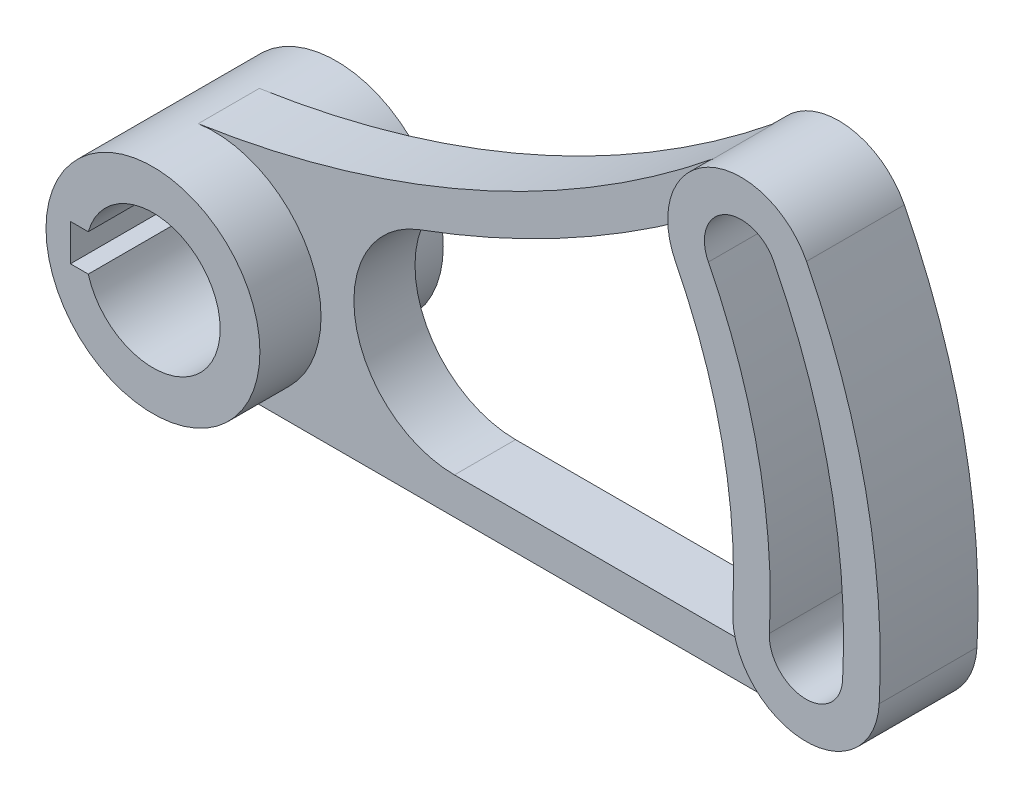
from build123d import *

# Parameters (mm, degrees)
CROQUIS1_R              = 17.5
SALIENTE_EXTRUIR1_DEPTH = 15
SALIENTE_EXTRUIR2_DEPTH = 8
SALIENTE_EXTRUIR3_DEPTH = 5


with BuildPart() as part:
    # Croquis1 → Saliente-Extruir1 (new, symmetric)
    with BuildSketch(Plane.XY):
        Circle(CROQUIS1_R)
        with BuildLine():
            ThreePointArc((-10.583005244, -3), (11, 0), (-10.583005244, 3))
            Line((-10.583005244, 3), (-13.5, 3))
            Line((-13.5, 3), (-13.5, -3))
            Line((-13.5, -3), (-10.583005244, -3))
        make_face(mode=Mode.SUBTRACT)
    extrude(amount=SALIENTE_EXTRUIR1_DEPTH, both=True)



with BuildPart() as body_2:
    # Croquis1_3 → Saliente-Extruir2 (new, symmetric)
    with BuildSketch(Plane.XY):
        with BuildLine():
            ThreePointArc((111.829341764, -6.180478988), (109.618475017, 22.973679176), (99.937290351, 50.562219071))
            ThreePointArc((99.937290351, 50.562219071), (83.812342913, 55.852405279), (78.522156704, 39.727457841))
            ThreePointArc((78.522156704, 39.727457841), (86.128801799, 18.050747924), (87.865911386, -4.856090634))
            ThreePointArc((87.865911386, -4.856090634), (99.185432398, -17.5), (111.829341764, -6.180478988))
        make_face()
        with BuildLine():
            ThreePointArc((105.83848417, -5.8493819), (103.746056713, 21.742946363), (94.583506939, 47.853528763))
            ThreePointArc((94.583506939, 47.853528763), (86.52103322, 50.498621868), (83.875940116, 42.436148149))
            ThreePointArc((83.875940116, 42.436148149), (92.001220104, 19.281480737), (93.856768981, -5.187187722))
            ThreePointArc((93.856768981, -5.187187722), (99.516529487, -11.509142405), (105.83848417, -5.8493819))
        make_face(mode=Mode.SUBTRACT)
    extrude(amount=SALIENTE_EXTRUIR2_DEPTH, both=True)


with BuildPart() as part_1:
    add(part.part)

    add(body_2.part)  # Saliente-Extruir3 merges body 2
    # Croquis1_4 → Saliente-Extruir3 (add, symmetric)
    with BuildSketch(Plane.XY):
        with BuildLine():
            ThreePointArc((17.5, 0), (12.374368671, -12.374368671), (0, -17.5))
            Line((0, -17.5), (99.185432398, -17.5))
            ThreePointArc((99.185432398, -17.5), (93.554078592, -15.735488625), (89.444786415, -11.5))
            Line((89.444786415, -11.5), (39.330537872, -11.5))
            ThreePointArc((39.330537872, -11.5), (23.127128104, 2.082169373), (33.670534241, 20.40871842))
            ThreePointArc((33.670534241, 20.40871842), (56.295814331, 30.501730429), (77.33090905, 43.589777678))
            ThreePointArc((77.33090905, 43.589777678), (78.084129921, 49.591831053), (81.669568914, 54.463854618))
            ThreePointArc((81.669568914, 54.463854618), (42.023781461, 30.242075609), (-2.598425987, 17.306015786))
            ThreePointArc((-2.598425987, 17.306015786), (11.418790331, 13.26126794), (17.5, 0))
        make_face()
    extrude(amount=SALIENTE_EXTRUIR3_DEPTH, both=True)


solid = part_1.part
